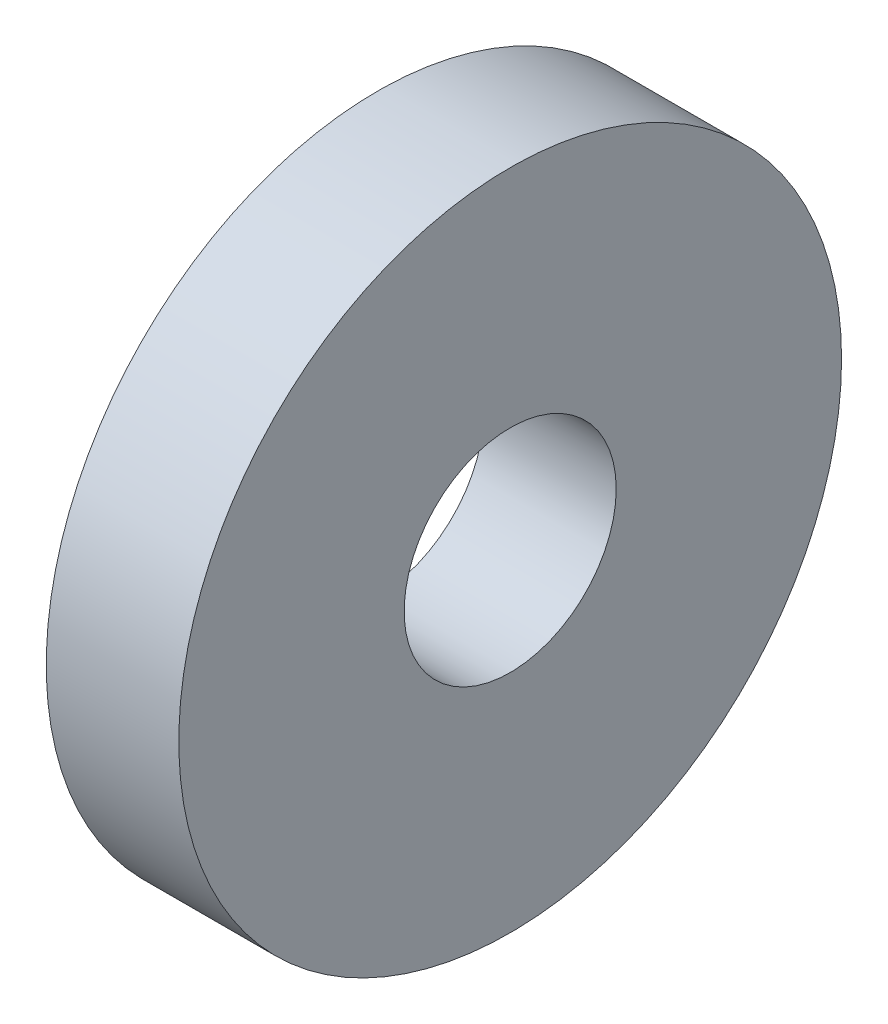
from build123d import *

# Parameters (mm, degrees)
SKETCH1_R      = 9.525
SKETCH1_R_2    = 3.048
EXTRUDE1_DEPTH = 3.81


with BuildPart() as part:
    # Sketch1 → Extrude1 (new body)
    with BuildSketch(Plane(origin=(0, 0, 0), x_dir=(0, 0, -1), z_dir=(1, 0, 0))):
        Circle(SKETCH1_R)
        Circle(SKETCH1_R_2, mode=Mode.SUBTRACT)
    extrude(amount=EXTRUDE1_DEPTH)


solid = part.part
